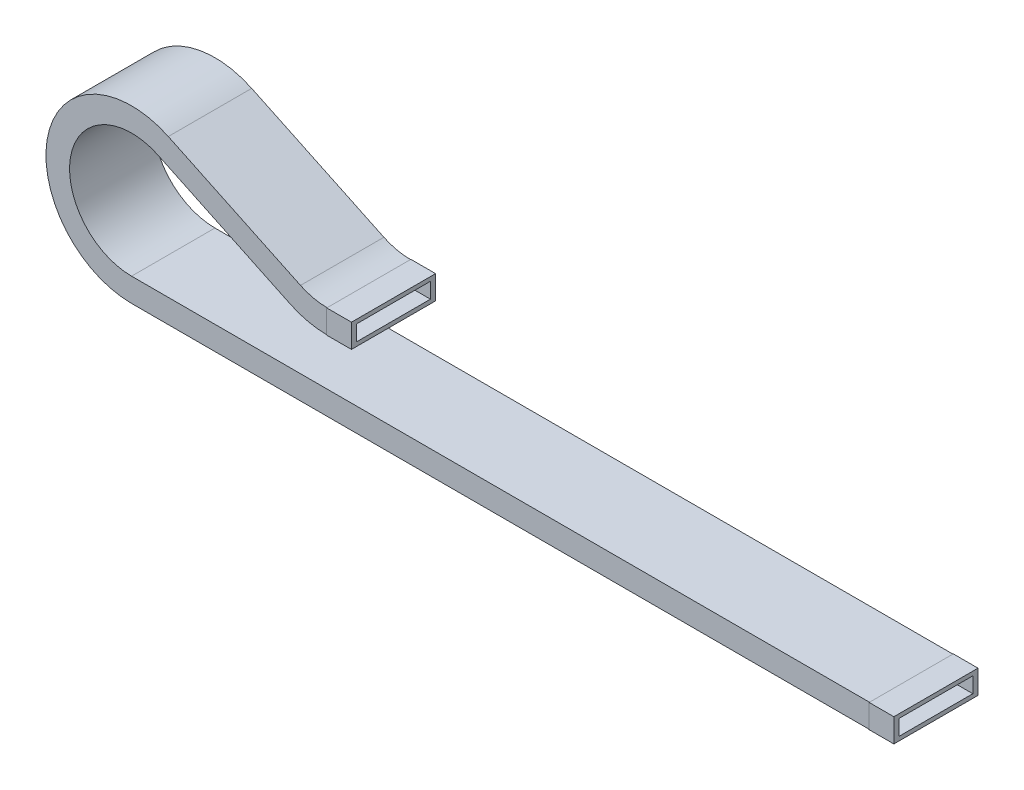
ISO-10303-21;
HEADER;
FILE_DESCRIPTION(('STEP AP214'),'2;1');
FILE_NAME('part.step','',(''),(''),'','','');
FILE_SCHEMA(('AUTOMOTIVE_DESIGN { 1 0 10303 214 1 1 1 1 }'));
ENDSEC;
DATA;
#1=APPLICATION_CONTEXT('core data for automotive mechanical design processes');
#2=APPLICATION_PROTOCOL_DEFINITION('international standard','automotive_design',2000,#1);
#3=PRODUCT_CONTEXT('',#1,'mechanical');
#4=PRODUCT('Part','Part','',(#3));
#5=PRODUCT_RELATED_PRODUCT_CATEGORY('part','',(#4));
#6=PRODUCT_DEFINITION_FORMATION('','',#4);
#7=PRODUCT_DEFINITION_CONTEXT('part definition',#1,'design');
#8=PRODUCT_DEFINITION('design','',#6,#7);
#9=PRODUCT_DEFINITION_SHAPE('','',#8);
#10=(LENGTH_UNIT() NAMED_UNIT(*) SI_UNIT(.MILLI.,.METRE.));
#11=(NAMED_UNIT(*) PLANE_ANGLE_UNIT() SI_UNIT($,.RADIAN.));
#12=(NAMED_UNIT(*) SI_UNIT($,.STERADIAN.) SOLID_ANGLE_UNIT());
#13=UNCERTAINTY_MEASURE_WITH_UNIT(LENGTH_MEASURE(1.E-05),#10,'distance_accuracy_value','');
#14=(GEOMETRIC_REPRESENTATION_CONTEXT(3) GLOBAL_UNCERTAINTY_ASSIGNED_CONTEXT((#13)) GLOBAL_UNIT_ASSIGNED_CONTEXT((#10,
#11,#12)) REPRESENTATION_CONTEXT('',''));
#15=CARTESIAN_POINT('',(0.,0.,0.));
#16=DIRECTION('',(0.,0.,1.));
#17=DIRECTION('',(1.,0.,0.));
#18=AXIS2_PLACEMENT_3D('',#15,#16,#17);
#19=CARTESIAN_POINT('',(-2067.,9.07607322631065E-12,113.));
#20=DIRECTION('',(0.,1.,0.));
#21=DIRECTION('',(0.,0.,1.));
#22=AXIS2_PLACEMENT_3D('',#19,#20,#21);
#23=PLANE('',#22);
#24=DIRECTION('',(0.,0.,1.));
#25=VECTOR('',#24,1.);
#26=CARTESIAN_POINT('',(-2067.,9.07607322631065E-12,113.));
#27=LINE('',#26,#25);
#28=CARTESIAN_POINT('',(-2067.,9.07607322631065E-12,-113.));
#29=VERTEX_POINT('',#28);
#30=CARTESIAN_POINT('',(-2067.,9.07607322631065E-12,113.));
#31=VERTEX_POINT('',#30);
#32=EDGE_CURVE('P0_E394',#29,#31,#27,.T.);
#33=ORIENTED_EDGE('',*,*,#32,.F.);
#34=DIRECTION('',(1.,0.,0.));
#35=VECTOR('',#34,1.);
#36=CARTESIAN_POINT('',(-2067.,9.07607322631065E-12,-113.));
#37=LINE('',#36,#35);
#38=CARTESIAN_POINT('',(-67.0000000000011,9.07607322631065E-12,-113.));
#39=VERTEX_POINT('',#38);
#40=EDGE_CURVE('P0_E24',#29,#39,#37,.T.);
#41=ORIENTED_EDGE('',*,*,#40,.T.);
#42=DIRECTION('',(0.,0.,1.));
#43=VECTOR('',#42,1.);
#44=CARTESIAN_POINT('',(-67.0000000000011,9.07607322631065E-12,113.));
#45=LINE('',#44,#43);
#46=CARTESIAN_POINT('',(-67.0000000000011,9.07607322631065E-12,113.));
#47=VERTEX_POINT('',#46);
#48=EDGE_CURVE('P0_E35',#39,#47,#45,.T.);
#49=ORIENTED_EDGE('',*,*,#48,.T.);
#50=DIRECTION('',(1.,0.,0.));
#51=VECTOR('',#50,1.);
#52=CARTESIAN_POINT('',(-2067.,9.07607322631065E-12,113.));
#53=LINE('',#52,#51);
#54=EDGE_CURVE('P0_E11',#31,#47,#53,.T.);
#55=ORIENTED_EDGE('',*,*,#54,.F.);
#56=EDGE_LOOP('',(#33,#41,#49,#55));
#57=FACE_BOUND('',#56,.T.);
#58=ADVANCED_FACE('P0_F16',(#57),#23,.F.);
#59=CARTESIAN_POINT('',(-2067.,64.0000000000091,113.));
#60=DIRECTION('',(0.,-1.,0.));
#61=DIRECTION('',(0.,0.,-1.));
#62=AXIS2_PLACEMENT_3D('',#59,#60,#61);
#63=PLANE('',#62);
#64=DIRECTION('',(0.,0.,-1.));
#65=VECTOR('',#64,1.);
#66=CARTESIAN_POINT('',(-2067.,64.0000000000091,113.));
#67=LINE('',#66,#65);
#68=CARTESIAN_POINT('',(-2067.,64.0000000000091,113.));
#69=VERTEX_POINT('',#68);
#70=CARTESIAN_POINT('',(-2067.,64.0000000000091,-113.));
#71=VERTEX_POINT('',#70);
#72=EDGE_CURVE('P0_E390',#69,#71,#67,.T.);
#73=ORIENTED_EDGE('',*,*,#72,.F.);
#74=DIRECTION('',(1.,0.,0.));
#75=VECTOR('',#74,1.);
#76=CARTESIAN_POINT('',(-2067.,64.0000000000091,113.));
#77=LINE('',#76,#75);
#78=CARTESIAN_POINT('',(-67.0000000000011,64.0000000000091,113.));
#79=VERTEX_POINT('',#78);
#80=EDGE_CURVE('P0_E426',#69,#79,#77,.T.);
#81=ORIENTED_EDGE('',*,*,#80,.T.);
#82=DIRECTION('',(0.,0.,-1.));
#83=VECTOR('',#82,1.);
#84=CARTESIAN_POINT('',(-67.0000000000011,64.0000000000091,113.));
#85=LINE('',#84,#83);
#86=CARTESIAN_POINT('',(-67.0000000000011,64.0000000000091,-113.));
#87=VERTEX_POINT('',#86);
#88=EDGE_CURVE('P0_E418',#79,#87,#85,.T.);
#89=ORIENTED_EDGE('',*,*,#88,.T.);
#90=DIRECTION('',(1.,0.,0.));
#91=VECTOR('',#90,1.);
#92=CARTESIAN_POINT('',(-2067.,64.0000000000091,-113.));
#93=LINE('',#92,#91);
#94=EDGE_CURVE('P0_E444',#71,#87,#93,.T.);
#95=ORIENTED_EDGE('',*,*,#94,.F.);
#96=EDGE_LOOP('',(#73,#81,#89,#95));
#97=FACE_BOUND('',#96,.T.);
#98=ADVANCED_FACE('P0_F565',(#97),#63,.F.);
#99=CARTESIAN_POINT('',(-2067.,53.0000000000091,100.));
#100=DIRECTION('',(0.,-1.,0.));
#101=DIRECTION('',(0.,0.,-1.));
#102=AXIS2_PLACEMENT_3D('',#99,#100,#101);
#103=PLANE('',#102);
#104=DIRECTION('',(0.,0.,-1.));
#105=VECTOR('',#104,1.);
#106=CARTESIAN_POINT('',(-2067.,53.0000000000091,100.));
#107=LINE('',#106,#105);
#108=CARTESIAN_POINT('',(-2067.,53.0000000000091,100.));
#109=VERTEX_POINT('',#108);
#110=CARTESIAN_POINT('',(-2067.,53.0000000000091,-99.9999999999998));
#111=VERTEX_POINT('',#110);
#112=EDGE_CURVE('P0_E386',#109,#111,#107,.T.);
#113=ORIENTED_EDGE('',*,*,#112,.T.);
#114=DIRECTION('',(1.,0.,0.));
#115=VECTOR('',#114,1.);
#116=CARTESIAN_POINT('',(-2067.,53.0000000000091,-99.9999999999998));
#117=LINE('',#116,#115);
#118=CARTESIAN_POINT('',(-67.0000000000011,53.0000000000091,-99.9999999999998));
#119=VERTEX_POINT('',#118);
#120=EDGE_CURVE('P0_E434',#111,#119,#117,.T.);
#121=ORIENTED_EDGE('',*,*,#120,.T.);
#122=DIRECTION('',(0.,0.,-1.));
#123=VECTOR('',#122,1.);
#124=CARTESIAN_POINT('',(-67.0000000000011,53.0000000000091,100.));
#125=LINE('',#124,#123);
#126=CARTESIAN_POINT('',(-67.0000000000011,53.0000000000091,100.));
#127=VERTEX_POINT('',#126);
#128=EDGE_CURVE('P0_E410',#127,#119,#125,.T.);
#129=ORIENTED_EDGE('',*,*,#128,.F.);
#130=DIRECTION('',(1.,0.,0.));
#131=VECTOR('',#130,1.);
#132=CARTESIAN_POINT('',(-2067.,53.0000000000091,100.));
#133=LINE('',#132,#131);
#134=EDGE_CURVE('P0_E419',#109,#127,#133,.T.);
#135=ORIENTED_EDGE('',*,*,#134,.F.);
#136=EDGE_LOOP('',(#113,#121,#129,#135));
#137=FACE_BOUND('',#136,.T.);
#138=ADVANCED_FACE('P0_F539',(#137),#103,.T.);
#139=CARTESIAN_POINT('',(-2067.,11.0000000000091,100.));
#140=DIRECTION('',(0.,1.,0.));
#141=DIRECTION('',(0.,0.,1.));
#142=AXIS2_PLACEMENT_3D('',#139,#140,#141);
#143=PLANE('',#142);
#144=DIRECTION('',(0.,0.,1.));
#145=VECTOR('',#144,1.);
#146=CARTESIAN_POINT('',(-2067.,11.0000000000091,100.));
#147=LINE('',#146,#145);
#148=CARTESIAN_POINT('',(-2067.,11.0000000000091,-99.9999999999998));
#149=VERTEX_POINT('',#148);
#150=CARTESIAN_POINT('',(-2067.,11.0000000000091,100.));
#151=VERTEX_POINT('',#150);
#152=EDGE_CURVE('P0_E382',#149,#151,#147,.T.);
#153=ORIENTED_EDGE('',*,*,#152,.T.);
#154=DIRECTION('',(1.,0.,0.));
#155=VECTOR('',#154,1.);
#156=CARTESIAN_POINT('',(-2067.,11.0000000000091,100.));
#157=LINE('',#156,#155);
#158=CARTESIAN_POINT('',(-67.0000000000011,11.0000000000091,100.));
#159=VERTEX_POINT('',#158);
#160=EDGE_CURVE('P0_E414',#151,#159,#157,.T.);
#161=ORIENTED_EDGE('',*,*,#160,.T.);
#162=DIRECTION('',(0.,0.,1.));
#163=VECTOR('',#162,1.);
#164=CARTESIAN_POINT('',(-67.0000000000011,11.0000000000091,100.));
#165=LINE('',#164,#163);
#166=CARTESIAN_POINT('',(-67.0000000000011,11.0000000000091,-99.9999999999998));
#167=VERTEX_POINT('',#166);
#168=EDGE_CURVE('P0_E402',#167,#159,#165,.T.);
#169=ORIENTED_EDGE('',*,*,#168,.F.);
#170=DIRECTION('',(1.,0.,0.));
#171=VECTOR('',#170,1.);
#172=CARTESIAN_POINT('',(-2067.,11.0000000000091,-99.9999999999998));
#173=LINE('',#172,#171);
#174=EDGE_CURVE('P0_E430',#149,#167,#173,.T.);
#175=ORIENTED_EDGE('',*,*,#174,.F.);
#176=EDGE_LOOP('',(#153,#161,#169,#175));
#177=FACE_BOUND('',#176,.T.);
#178=ADVANCED_FACE('P0_F546',(#177),#143,.T.);
#179=CARTESIAN_POINT('',(-2067.,232.010000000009,1.89806750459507E-13));
#180=DIRECTION('',(0.,0.,1.));
#181=DIRECTION('',(1.,0.,0.));
#182=AXIS2_PLACEMENT_3D('',#179,#180,#181);
#183=CYLINDRICAL_SURFACE('',#182,232.01);
#184=DIRECTION('',(0.,0.,1.));
#185=VECTOR('',#184,1.);
#186=CARTESIAN_POINT('',(-1967.40267090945,441.554773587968,113.));
#187=LINE('',#186,#185);
#188=CARTESIAN_POINT('',(-1967.40267090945,441.554773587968,-113.));
#189=VERTEX_POINT('',#188);
#190=CARTESIAN_POINT('',(-1967.40267090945,441.554773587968,113.));
#191=VERTEX_POINT('',#190);
#192=EDGE_CURVE('P0_E324',#189,#191,#187,.T.);
#193=ORIENTED_EDGE('',*,*,#192,.F.);
#194=CARTESIAN_POINT('',(-2067.,232.010000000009,-113.));
#195=DIRECTION('',(0.,0.,1.));
#196=DIRECTION('',(1.,0.,0.));
#197=AXIS2_PLACEMENT_3D('',#194,#195,#196);
#198=CIRCLE('',#197,232.01);
#199=EDGE_CURVE('P0_E376',#189,#29,#198,.T.);
#200=ORIENTED_EDGE('',*,*,#199,.T.);
#201=ORIENTED_EDGE('',*,*,#32,.T.);
#202=CARTESIAN_POINT('',(-2067.,232.010000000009,113.));
#203=DIRECTION('',(0.,0.,1.));
#204=DIRECTION('',(1.,0.,0.));
#205=AXIS2_PLACEMENT_3D('',#202,#203,#204);
#206=CIRCLE('',#205,232.01);
#207=EDGE_CURVE('P0_E379',#191,#31,#206,.T.);
#208=ORIENTED_EDGE('',*,*,#207,.F.);
#209=EDGE_LOOP('',(#193,#200,#201,#208));
#210=FACE_BOUND('',#209,.T.);
#211=ADVANCED_FACE('P0_F453',(#210),#183,.T.);
#212=CARTESIAN_POINT('',(-2067.,232.010000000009,1.89806750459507E-13));
#213=DIRECTION('',(0.,0.,1.));
#214=DIRECTION('',(1.,0.,0.));
#215=AXIS2_PLACEMENT_3D('',#212,#213,#214);
#216=CYLINDRICAL_SURFACE('',#215,168.01);
#217=DIRECTION('',(0.,0.,-1.));
#218=VECTOR('',#217,1.);
#219=CARTESIAN_POINT('',(-1994.87661195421,383.75181031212,113.));
#220=LINE('',#219,#218);
#221=CARTESIAN_POINT('',(-1994.87661195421,383.75181031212,113.));
#222=VERTEX_POINT('',#221);
#223=CARTESIAN_POINT('',(-1994.87661195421,383.75181031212,-113.));
#224=VERTEX_POINT('',#223);
#225=EDGE_CURVE('P0_E320',#222,#224,#220,.T.);
#226=ORIENTED_EDGE('',*,*,#225,.F.);
#227=CARTESIAN_POINT('',(-2067.,232.010000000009,113.));
#228=DIRECTION('',(0.,0.,1.));
#229=DIRECTION('',(1.,0.,0.));
#230=AXIS2_PLACEMENT_3D('',#227,#228,#229);
#231=CIRCLE('',#230,168.01);
#232=EDGE_CURVE('P0_E370',#222,#69,#231,.T.);
#233=ORIENTED_EDGE('',*,*,#232,.T.);
#234=ORIENTED_EDGE('',*,*,#72,.T.);
#235=CARTESIAN_POINT('',(-2067.,232.010000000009,-113.));
#236=DIRECTION('',(0.,0.,1.));
#237=DIRECTION('',(1.,0.,0.));
#238=AXIS2_PLACEMENT_3D('',#235,#236,#237);
#239=CIRCLE('',#238,168.01);
#240=EDGE_CURVE('P0_E373',#224,#71,#239,.T.);
#241=ORIENTED_EDGE('',*,*,#240,.F.);
#242=EDGE_LOOP('',(#226,#233,#234,#241));
#243=FACE_BOUND('',#242,.T.);
#244=ADVANCED_FACE('P0_F580',(#243),#216,.F.);
#245=CARTESIAN_POINT('',(-2067.,232.010000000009,1.89806750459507E-13));
#246=DIRECTION('',(0.,0.,1.));
#247=DIRECTION('',(1.,0.,0.));
#248=AXIS2_PLACEMENT_3D('',#245,#246,#247);
#249=CYLINDRICAL_SURFACE('',#248,179.01);
#250=DIRECTION('',(0.,0.,-1.));
#251=VECTOR('',#250,1.);
#252=CARTESIAN_POINT('',(-1990.15452833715,393.686694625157,100.));
#253=LINE('',#252,#251);
#254=CARTESIAN_POINT('',(-1990.15452833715,393.686694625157,100.));
#255=VERTEX_POINT('',#254);
#256=CARTESIAN_POINT('',(-1990.15452833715,393.686694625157,-99.9999999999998));
#257=VERTEX_POINT('',#256);
#258=EDGE_CURVE('P0_E316',#255,#257,#253,.T.);
#259=ORIENTED_EDGE('',*,*,#258,.T.);
#260=CARTESIAN_POINT('',(-2067.,232.010000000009,-99.9999999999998));
#261=DIRECTION('',(0.,0.,1.));
#262=DIRECTION('',(1.,0.,0.));
#263=AXIS2_PLACEMENT_3D('',#260,#261,#262);
#264=CIRCLE('',#263,179.01);
#265=EDGE_CURVE('P0_E364',#257,#111,#264,.T.);
#266=ORIENTED_EDGE('',*,*,#265,.T.);
#267=ORIENTED_EDGE('',*,*,#112,.F.);
#268=CARTESIAN_POINT('',(-2067.,232.010000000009,100.));
#269=DIRECTION('',(0.,0.,1.));
#270=DIRECTION('',(1.,0.,0.));
#271=AXIS2_PLACEMENT_3D('',#268,#269,#270);
#272=CIRCLE('',#271,179.01);
#273=EDGE_CURVE('P0_E367',#255,#109,#272,.T.);
#274=ORIENTED_EDGE('',*,*,#273,.F.);
#275=EDGE_LOOP('',(#259,#266,#267,#274));
#276=FACE_BOUND('',#275,.T.);
#277=ADVANCED_FACE('P0_F535',(#276),#249,.T.);
#278=CARTESIAN_POINT('',(-2067.,232.010000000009,1.89806750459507E-13));
#279=DIRECTION('',(0.,0.,1.));
#280=DIRECTION('',(1.,0.,0.));
#281=AXIS2_PLACEMENT_3D('',#278,#279,#280);
#282=CYLINDRICAL_SURFACE('',#281,221.01);
#283=DIRECTION('',(0.,0.,1.));
#284=VECTOR('',#283,1.);
#285=CARTESIAN_POINT('',(-1972.12475452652,431.619889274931,100.));
#286=LINE('',#285,#284);
#287=CARTESIAN_POINT('',(-1972.12475452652,431.619889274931,-99.9999999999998));
#288=VERTEX_POINT('',#287);
#289=CARTESIAN_POINT('',(-1972.12475452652,431.619889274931,100.));
#290=VERTEX_POINT('',#289);
#291=EDGE_CURVE('P0_E312',#288,#290,#286,.T.);
#292=ORIENTED_EDGE('',*,*,#291,.T.);
#293=CARTESIAN_POINT('',(-2067.,232.010000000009,100.));
#294=DIRECTION('',(0.,0.,1.));
#295=DIRECTION('',(1.,0.,0.));
#296=AXIS2_PLACEMENT_3D('',#293,#294,#295);
#297=CIRCLE('',#296,221.01);
#298=EDGE_CURVE('P0_E358',#290,#151,#297,.T.);
#299=ORIENTED_EDGE('',*,*,#298,.T.);
#300=ORIENTED_EDGE('',*,*,#152,.F.);
#301=CARTESIAN_POINT('',(-2067.,232.010000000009,-99.9999999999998));
#302=DIRECTION('',(0.,0.,1.));
#303=DIRECTION('',(1.,0.,0.));
#304=AXIS2_PLACEMENT_3D('',#301,#302,#303);
#305=CIRCLE('',#304,221.01);
#306=EDGE_CURVE('P0_E361',#288,#149,#305,.T.);
#307=ORIENTED_EDGE('',*,*,#306,.F.);
#308=EDGE_LOOP('',(#292,#299,#300,#307));
#309=FACE_BOUND('',#308,.T.);
#310=ADVANCED_FACE('P0_F549',(#309),#282,.F.);
#311=CARTESIAN_POINT('',(-1609.13338804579,271.268189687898,113.));
#312=DIRECTION('',(-0.429280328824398,-0.903171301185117,0.));
#313=DIRECTION('',(0.903171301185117,-0.429280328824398,0.));
#314=AXIS2_PLACEMENT_3D('',#311,#312,#313);
#315=PLANE('',#314);
#316=DIRECTION('',(0.,0.,1.));
#317=VECTOR('',#316,1.);
#318=CARTESIAN_POINT('',(-1609.13338804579,271.268189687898,113.));
#319=LINE('',#318,#317);
#320=CARTESIAN_POINT('',(-1609.13338804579,271.268189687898,-113.));
#321=VERTEX_POINT('',#320);
#322=CARTESIAN_POINT('',(-1609.13338804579,271.268189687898,113.));
#323=VERTEX_POINT('',#322);
#324=EDGE_CURVE('P0_E282',#321,#323,#319,.T.);
#325=ORIENTED_EDGE('',*,*,#324,.F.);
#326=DIRECTION('',(-0.903171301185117,0.429280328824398,0.));
#327=VECTOR('',#326,1.);
#328=CARTESIAN_POINT('',(-1609.13338804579,271.268189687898,-113.));
#329=LINE('',#328,#327);
#330=EDGE_CURVE('P0_E350',#321,#189,#329,.T.);
#331=ORIENTED_EDGE('',*,*,#330,.T.);
#332=ORIENTED_EDGE('',*,*,#192,.T.);
#333=DIRECTION('',(-0.903171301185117,0.429280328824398,0.));
#334=VECTOR('',#333,1.);
#335=CARTESIAN_POINT('',(-1609.13338804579,271.268189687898,113.));
#336=LINE('',#335,#334);
#337=EDGE_CURVE('P0_E354',#323,#191,#336,.T.);
#338=ORIENTED_EDGE('',*,*,#337,.F.);
#339=EDGE_LOOP('',(#325,#331,#332,#338));
#340=FACE_BOUND('',#339,.T.);
#341=ADVANCED_FACE('P0_F455',(#340),#315,.F.);
#342=CARTESIAN_POINT('',(-1636.60732909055,213.46522641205,113.));
#343=DIRECTION('',(0.429280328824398,0.903171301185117,0.));
#344=DIRECTION('',(-0.903171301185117,0.429280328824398,0.));
#345=AXIS2_PLACEMENT_3D('',#342,#343,#344);
#346=PLANE('',#345);
#347=DIRECTION('',(0.,0.,-1.));
#348=VECTOR('',#347,1.);
#349=CARTESIAN_POINT('',(-1636.60732909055,213.46522641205,113.));
#350=LINE('',#349,#348);
#351=CARTESIAN_POINT('',(-1636.60732909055,213.46522641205,113.));
#352=VERTEX_POINT('',#351);
#353=CARTESIAN_POINT('',(-1636.60732909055,213.46522641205,-113.));
#354=VERTEX_POINT('',#353);
#355=EDGE_CURVE('P0_E278',#352,#354,#350,.T.);
#356=ORIENTED_EDGE('',*,*,#355,.F.);
#357=DIRECTION('',(-0.903171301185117,0.429280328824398,0.));
#358=VECTOR('',#357,1.);
#359=CARTESIAN_POINT('',(-1636.60732909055,213.46522641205,113.));
#360=LINE('',#359,#358);
#361=EDGE_CURVE('P0_E329',#352,#222,#360,.T.);
#362=ORIENTED_EDGE('',*,*,#361,.T.);
#363=ORIENTED_EDGE('',*,*,#225,.T.);
#364=DIRECTION('',(-0.903171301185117,0.429280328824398,0.));
#365=VECTOR('',#364,1.);
#366=CARTESIAN_POINT('',(-1636.60732909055,213.46522641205,-113.));
#367=LINE('',#366,#365);
#368=EDGE_CURVE('P0_E346',#354,#224,#367,.T.);
#369=ORIENTED_EDGE('',*,*,#368,.F.);
#370=EDGE_LOOP('',(#356,#362,#363,#369));
#371=FACE_BOUND('',#370,.T.);
#372=ADVANCED_FACE('P0_F562',(#371),#346,.F.);
#373=CARTESIAN_POINT('',(-1631.88524547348,223.400110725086,100.));
#374=DIRECTION('',(0.429280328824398,0.903171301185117,0.));
#375=DIRECTION('',(-0.903171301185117,0.429280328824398,0.));
#376=AXIS2_PLACEMENT_3D('',#373,#374,#375);
#377=PLANE('',#376);
#378=DIRECTION('',(0.,0.,-1.));
#379=VECTOR('',#378,1.);
#380=CARTESIAN_POINT('',(-1631.88524547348,223.400110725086,100.));
#381=LINE('',#380,#379);
#382=CARTESIAN_POINT('',(-1631.88524547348,223.400110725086,100.));
#383=VERTEX_POINT('',#382);
#384=CARTESIAN_POINT('',(-1631.88524547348,223.400110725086,-99.9999999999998));
#385=VERTEX_POINT('',#384);
#386=EDGE_CURVE('P0_E239',#383,#385,#381,.T.);
#387=ORIENTED_EDGE('',*,*,#386,.T.);
#388=DIRECTION('',(-0.903171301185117,0.429280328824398,0.));
#389=VECTOR('',#388,1.);
#390=CARTESIAN_POINT('',(-1631.88524547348,223.400110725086,-99.9999999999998));
#391=LINE('',#390,#389);
#392=EDGE_CURVE('P0_E336',#385,#257,#391,.T.);
#393=ORIENTED_EDGE('',*,*,#392,.T.);
#394=ORIENTED_EDGE('',*,*,#258,.F.);
#395=DIRECTION('',(-0.903171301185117,0.429280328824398,0.));
#396=VECTOR('',#395,1.);
#397=CARTESIAN_POINT('',(-1631.88524547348,223.400110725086,100.));
#398=LINE('',#397,#396);
#399=EDGE_CURVE('P0_E325',#383,#255,#398,.T.);
#400=ORIENTED_EDGE('',*,*,#399,.F.);
#401=EDGE_LOOP('',(#387,#393,#394,#400));
#402=FACE_BOUND('',#401,.T.);
#403=ADVANCED_FACE('P0_F533',(#402),#377,.T.);
#404=CARTESIAN_POINT('',(-1613.85547166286,261.333305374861,100.));
#405=DIRECTION('',(-0.429280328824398,-0.903171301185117,0.));
#406=DIRECTION('',(0.903171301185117,-0.429280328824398,0.));
#407=AXIS2_PLACEMENT_3D('',#404,#405,#406);
#408=PLANE('',#407);
#409=DIRECTION('',(0.,0.,1.));
#410=VECTOR('',#409,1.);
#411=CARTESIAN_POINT('',(-1613.85547166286,261.333305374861,100.));
#412=LINE('',#411,#410);
#413=CARTESIAN_POINT('',(-1613.85547166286,261.333305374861,-99.9999999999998));
#414=VERTEX_POINT('',#413);
#415=CARTESIAN_POINT('',(-1613.85547166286,261.333305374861,100.));
#416=VERTEX_POINT('',#415);
#417=EDGE_CURVE('P0_E271',#414,#416,#412,.T.);
#418=ORIENTED_EDGE('',*,*,#417,.T.);
#419=DIRECTION('',(-0.903171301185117,0.429280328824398,0.));
#420=VECTOR('',#419,1.);
#421=CARTESIAN_POINT('',(-1613.85547166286,261.333305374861,100.));
#422=LINE('',#421,#420);
#423=EDGE_CURVE('P0_E233',#416,#290,#422,.T.);
#424=ORIENTED_EDGE('',*,*,#423,.T.);
#425=ORIENTED_EDGE('',*,*,#291,.F.);
#426=DIRECTION('',(-0.903171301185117,0.429280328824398,0.));
#427=VECTOR('',#426,1.);
#428=CARTESIAN_POINT('',(-1613.85547166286,261.333305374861,-99.9999999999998));
#429=LINE('',#428,#427);
#430=EDGE_CURVE('P0_E332',#414,#288,#429,.T.);
#431=ORIENTED_EDGE('',*,*,#430,.F.);
#432=EDGE_LOOP('',(#418,#424,#425,#431));
#433=FACE_BOUND('',#432,.T.);
#434=ADVANCED_FACE('P0_F552',(#433),#408,.T.);
#435=CARTESIAN_POINT('',(-1537.01,423.010000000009,1.89806750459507E-13));
#436=DIRECTION('',(0.,0.,-1.));
#437=DIRECTION('',(-1.,0.,0.));
#438=AXIS2_PLACEMENT_3D('',#435,#436,#437);
#439=CYLINDRICAL_SURFACE('',#438,168.01);
#440=DIRECTION('',(0.,0.,1.));
#441=VECTOR('',#440,1.);
#442=CARTESIAN_POINT('',(-1537.01,255.000000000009,113.));
#443=LINE('',#442,#441);
#444=CARTESIAN_POINT('',(-1537.01,255.000000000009,-113.));
#445=VERTEX_POINT('',#444);
#446=CARTESIAN_POINT('',(-1537.01,255.000000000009,113.));
#447=VERTEX_POINT('',#446);
#448=EDGE_CURVE('P0_E257',#445,#447,#443,.T.);
#449=ORIENTED_EDGE('',*,*,#448,.F.);
#450=CARTESIAN_POINT('',(-1537.01,423.010000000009,-113.));
#451=DIRECTION('',(0.,0.,-1.));
#452=DIRECTION('',(-1.,0.,0.));
#453=AXIS2_PLACEMENT_3D('',#450,#451,#452);
#454=CIRCLE('',#453,168.01);
#455=EDGE_CURVE('P0_E304',#445,#321,#454,.T.);
#456=ORIENTED_EDGE('',*,*,#455,.T.);
#457=ORIENTED_EDGE('',*,*,#324,.T.);
#458=CARTESIAN_POINT('',(-1537.01,423.010000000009,113.));
#459=DIRECTION('',(0.,0.,-1.));
#460=DIRECTION('',(-1.,0.,0.));
#461=AXIS2_PLACEMENT_3D('',#458,#459,#460);
#462=CIRCLE('',#461,168.01);
#463=EDGE_CURVE('P0_E308',#447,#323,#462,.T.);
#464=ORIENTED_EDGE('',*,*,#463,.F.);
#465=EDGE_LOOP('',(#449,#456,#457,#464));
#466=FACE_BOUND('',#465,.T.);
#467=ADVANCED_FACE('P0_F458',(#466),#439,.F.);
#468=CARTESIAN_POINT('',(-1537.01,423.010000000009,1.89806750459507E-13));
#469=DIRECTION('',(0.,0.,-1.));
#470=DIRECTION('',(-1.,0.,0.));
#471=AXIS2_PLACEMENT_3D('',#468,#469,#470);
#472=CYLINDRICAL_SURFACE('',#471,232.01);
#473=DIRECTION('',(0.,0.,-1.));
#474=VECTOR('',#473,1.);
#475=CARTESIAN_POINT('',(-1537.01,191.000000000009,113.));
#476=LINE('',#475,#474);
#477=CARTESIAN_POINT('',(-1537.01,191.000000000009,113.));
#478=VERTEX_POINT('',#477);
#479=CARTESIAN_POINT('',(-1537.01,191.000000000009,-113.));
#480=VERTEX_POINT('',#479);
#481=EDGE_CURVE('P0_E267',#478,#480,#476,.T.);
#482=ORIENTED_EDGE('',*,*,#481,.F.);
#483=CARTESIAN_POINT('',(-1537.01,423.010000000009,113.));
#484=DIRECTION('',(0.,0.,-1.));
#485=DIRECTION('',(-1.,0.,0.));
#486=AXIS2_PLACEMENT_3D('',#483,#484,#485);
#487=CIRCLE('',#486,232.01);
#488=EDGE_CURVE('P0_E286',#478,#352,#487,.T.);
#489=ORIENTED_EDGE('',*,*,#488,.T.);
#490=ORIENTED_EDGE('',*,*,#355,.T.);
#491=CARTESIAN_POINT('',(-1537.01,423.010000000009,-113.));
#492=DIRECTION('',(0.,0.,-1.));
#493=DIRECTION('',(-1.,0.,0.));
#494=AXIS2_PLACEMENT_3D('',#491,#492,#493);
#495=CIRCLE('',#494,232.01);
#496=EDGE_CURVE('P0_E300',#480,#354,#495,.T.);
#497=ORIENTED_EDGE('',*,*,#496,.F.);
#498=EDGE_LOOP('',(#482,#489,#490,#497));
#499=FACE_BOUND('',#498,.T.);
#500=ADVANCED_FACE('P0_F560',(#499),#472,.T.);
#501=CARTESIAN_POINT('',(-1537.01,423.010000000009,1.89806750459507E-13));
#502=DIRECTION('',(0.,0.,-1.));
#503=DIRECTION('',(-1.,0.,0.));
#504=AXIS2_PLACEMENT_3D('',#501,#502,#503);
#505=CYLINDRICAL_SURFACE('',#504,221.01);
#506=DIRECTION('',(0.,0.,-1.));
#507=VECTOR('',#506,1.);
#508=CARTESIAN_POINT('',(-1537.01,202.000000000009,100.));
#509=LINE('',#508,#507);
#510=CARTESIAN_POINT('',(-1537.01,202.000000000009,100.));
#511=VERTEX_POINT('',#510);
#512=CARTESIAN_POINT('',(-1537.01,202.000000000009,-99.9999999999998));
#513=VERTEX_POINT('',#512);
#514=EDGE_CURVE('P0_E249',#511,#513,#509,.T.);
#515=ORIENTED_EDGE('',*,*,#514,.T.);
#516=CARTESIAN_POINT('',(-1537.01,423.010000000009,-99.9999999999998));
#517=DIRECTION('',(0.,0.,-1.));
#518=DIRECTION('',(-1.,0.,0.));
#519=AXIS2_PLACEMENT_3D('',#516,#517,#518);
#520=CIRCLE('',#519,221.01);
#521=EDGE_CURVE('P0_E290',#513,#385,#520,.T.);
#522=ORIENTED_EDGE('',*,*,#521,.T.);
#523=ORIENTED_EDGE('',*,*,#386,.F.);
#524=CARTESIAN_POINT('',(-1537.01,423.010000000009,100.));
#525=DIRECTION('',(0.,0.,-1.));
#526=DIRECTION('',(-1.,0.,0.));
#527=AXIS2_PLACEMENT_3D('',#524,#525,#526);
#528=CIRCLE('',#527,221.01);
#529=EDGE_CURVE('P0_E283',#511,#383,#528,.T.);
#530=ORIENTED_EDGE('',*,*,#529,.F.);
#531=EDGE_LOOP('',(#515,#522,#523,#530));
#532=FACE_BOUND('',#531,.T.);
#533=ADVANCED_FACE('P0_F527',(#532),#505,.F.);
#534=CARTESIAN_POINT('',(-1537.01,423.010000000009,1.89806750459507E-13));
#535=DIRECTION('',(0.,0.,-1.));
#536=DIRECTION('',(-1.,0.,0.));
#537=AXIS2_PLACEMENT_3D('',#534,#535,#536);
#538=CYLINDRICAL_SURFACE('',#537,179.01);
#539=DIRECTION('',(0.,0.,1.));
#540=VECTOR('',#539,1.);
#541=CARTESIAN_POINT('',(-1537.01,244.000000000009,100.));
#542=LINE('',#541,#540);
#543=CARTESIAN_POINT('',(-1537.01,244.000000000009,-99.9999999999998));
#544=VERTEX_POINT('',#543);
#545=CARTESIAN_POINT('',(-1537.01,244.000000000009,100.));
#546=VERTEX_POINT('',#545);
#547=EDGE_CURVE('P0_E242',#544,#546,#542,.T.);
#548=ORIENTED_EDGE('',*,*,#547,.T.);
#549=CARTESIAN_POINT('',(-1537.01,423.010000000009,100.));
#550=DIRECTION('',(0.,0.,-1.));
#551=DIRECTION('',(-1.,0.,0.));
#552=AXIS2_PLACEMENT_3D('',#549,#550,#551);
#553=CIRCLE('',#552,179.01);
#554=EDGE_CURVE('P0_E225',#546,#416,#553,.T.);
#555=ORIENTED_EDGE('',*,*,#554,.T.);
#556=ORIENTED_EDGE('',*,*,#417,.F.);
#557=CARTESIAN_POINT('',(-1537.01,423.010000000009,-99.9999999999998));
#558=DIRECTION('',(0.,0.,-1.));
#559=DIRECTION('',(-1.,0.,0.));
#560=AXIS2_PLACEMENT_3D('',#557,#558,#559);
#561=CIRCLE('',#560,179.01);
#562=EDGE_CURVE('P0_E238',#544,#414,#561,.T.);
#563=ORIENTED_EDGE('',*,*,#562,.F.);
#564=EDGE_LOOP('',(#548,#555,#556,#563));
#565=FACE_BOUND('',#564,.T.);
#566=ADVANCED_FACE('P0_F243',(#565),#538,.T.);
#567=CARTESIAN_POINT('',(-1537.01,255.000000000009,113.));
#568=DIRECTION('',(0.,0.,1.));
#569=DIRECTION('',(1.,0.,0.));
#570=AXIS2_PLACEMENT_3D('',#567,#568,#569);
#571=PLANE('',#570);
#572=DIRECTION('',(0.,-1.,0.));
#573=VECTOR('',#572,1.);
#574=CARTESIAN_POINT('',(-1537.,255.000000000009,113.));
#575=LINE('',#574,#573);
#576=CARTESIAN_POINT('',(-1537.,255.000000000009,113.));
#577=VERTEX_POINT('',#576);
#578=CARTESIAN_POINT('',(-1537.,191.000000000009,113.));
#579=VERTEX_POINT('',#578);
#580=EDGE_CURVE('P0_E509',#577,#579,#575,.T.);
#581=ORIENTED_EDGE('',*,*,#580,.F.);
#582=DIRECTION('',(1.,-8.32667268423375E-12,0.));
#583=VECTOR('',#582,1.);
#584=CARTESIAN_POINT('',(-1537.01,255.000000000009,113.));
#585=LINE('',#584,#583);
#586=EDGE_CURVE('P0_E274',#447,#577,#585,.T.);
#587=ORIENTED_EDGE('',*,*,#586,.F.);
#588=ORIENTED_EDGE('',*,*,#463,.T.);
#589=ORIENTED_EDGE('',*,*,#337,.T.);
#590=ORIENTED_EDGE('',*,*,#207,.T.);
#591=ORIENTED_EDGE('',*,*,#54,.T.);
#592=DIRECTION('',(0.,1.,0.));
#593=VECTOR('',#592,1.);
#594=CARTESIAN_POINT('',(-67.0000000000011,9.07607322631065E-12,113.));
#595=LINE('',#594,#593);
#596=EDGE_CURVE('P0_E415',#47,#79,#595,.T.);
#597=ORIENTED_EDGE('',*,*,#596,.T.);
#598=ORIENTED_EDGE('',*,*,#80,.F.);
#599=ORIENTED_EDGE('',*,*,#232,.F.);
#600=ORIENTED_EDGE('',*,*,#361,.F.);
#601=ORIENTED_EDGE('',*,*,#488,.F.);
#602=DIRECTION('',(1.,-8.32667268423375E-12,0.));
#603=VECTOR('',#602,1.);
#604=CARTESIAN_POINT('',(-1537.01,191.000000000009,113.));
#605=LINE('',#604,#603);
#606=EDGE_CURVE('P0_E488',#478,#579,#605,.T.);
#607=ORIENTED_EDGE('',*,*,#606,.T.);
#608=EDGE_LOOP('',(#581,#587,#588,#589,#590,#591,#597,#598,#599,#600,#601,#607));
#609=FACE_BOUND('',#608,.T.);
#610=ADVANCED_FACE('P0_F599',(#609),#571,.T.);
#611=CARTESIAN_POINT('',(-1537.01,255.000000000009,113.));
#612=DIRECTION('',(8.32667268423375E-12,1.,0.));
#613=DIRECTION('',(-1.,8.32667268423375E-12,0.));
#614=AXIS2_PLACEMENT_3D('',#611,#612,#613);
#615=PLANE('',#614);
#616=DIRECTION('',(0.,0.,1.));
#617=VECTOR('',#616,1.);
#618=CARTESIAN_POINT('',(-1537.,255.000000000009,113.));
#619=LINE('',#618,#617);
#620=CARTESIAN_POINT('',(-1537.,255.000000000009,-113.));
#621=VERTEX_POINT('',#620);
#622=EDGE_CURVE('P0_E250',#621,#577,#619,.T.);
#623=ORIENTED_EDGE('',*,*,#622,.F.);
#624=DIRECTION('',(1.,-8.32667268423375E-12,0.));
#625=VECTOR('',#624,1.);
#626=CARTESIAN_POINT('',(-1537.01,255.000000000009,-113.));
#627=LINE('',#626,#625);
#628=EDGE_CURVE('P0_E460',#445,#621,#627,.T.);
#629=ORIENTED_EDGE('',*,*,#628,.F.);
#630=ORIENTED_EDGE('',*,*,#448,.T.);
#631=ORIENTED_EDGE('',*,*,#586,.T.);
#632=EDGE_LOOP('',(#623,#629,#630,#631));
#633=FACE_BOUND('',#632,.T.);
#634=ADVANCED_FACE('P0_F478',(#633),#615,.T.);
#635=CARTESIAN_POINT('',(-1537.01,255.000000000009,-113.));
#636=DIRECTION('',(0.,0.,-1.));
#637=DIRECTION('',(-1.,0.,0.));
#638=AXIS2_PLACEMENT_3D('',#635,#636,#637);
#639=PLANE('',#638);
#640=DIRECTION('',(0.,1.,0.));
#641=VECTOR('',#640,1.);
#642=CARTESIAN_POINT('',(-1537.,255.000000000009,-113.));
#643=LINE('',#642,#641);
#644=CARTESIAN_POINT('',(-1537.,191.000000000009,-113.));
#645=VERTEX_POINT('',#644);
#646=EDGE_CURVE('P0_E463',#645,#621,#643,.T.);
#647=ORIENTED_EDGE('',*,*,#646,.F.);
#648=DIRECTION('',(1.,-8.32667268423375E-12,0.));
#649=VECTOR('',#648,1.);
#650=CARTESIAN_POINT('',(-1537.01,191.000000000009,-113.));
#651=LINE('',#650,#649);
#652=EDGE_CURVE('P0_E468',#480,#645,#651,.T.);
#653=ORIENTED_EDGE('',*,*,#652,.F.);
#654=ORIENTED_EDGE('',*,*,#496,.T.);
#655=ORIENTED_EDGE('',*,*,#368,.T.);
#656=ORIENTED_EDGE('',*,*,#240,.T.);
#657=ORIENTED_EDGE('',*,*,#94,.T.);
#658=DIRECTION('',(0.,-1.,0.));
#659=VECTOR('',#658,1.);
#660=CARTESIAN_POINT('',(-67.0000000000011,9.07607322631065E-12,-113.));
#661=LINE('',#660,#659);
#662=EDGE_CURVE('P0_E46',#87,#39,#661,.T.);
#663=ORIENTED_EDGE('',*,*,#662,.T.);
#664=ORIENTED_EDGE('',*,*,#40,.F.);
#665=ORIENTED_EDGE('',*,*,#199,.F.);
#666=ORIENTED_EDGE('',*,*,#330,.F.);
#667=ORIENTED_EDGE('',*,*,#455,.F.);
#668=ORIENTED_EDGE('',*,*,#628,.T.);
#669=EDGE_LOOP('',(#647,#653,#654,#655,#656,#657,#663,#664,#665,#666,#667,#668));
#670=FACE_BOUND('',#669,.T.);
#671=ADVANCED_FACE('P0_F449',(#670),#639,.T.);
#672=CARTESIAN_POINT('',(-1537.01,244.000000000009,100.));
#673=DIRECTION('',(0.,0.,1.));
#674=DIRECTION('',(1.,0.,0.));
#675=AXIS2_PLACEMENT_3D('',#672,#673,#674);
#676=PLANE('',#675);
#677=DIRECTION('',(0.,-1.,0.));
#678=VECTOR('',#677,1.);
#679=CARTESIAN_POINT('',(-1537.,244.000000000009,100.));
#680=LINE('',#679,#678);
#681=CARTESIAN_POINT('',(-1537.,244.000000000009,100.));
#682=VERTEX_POINT('',#681);
#683=CARTESIAN_POINT('',(-1537.,202.000000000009,100.));
#684=VERTEX_POINT('',#683);
#685=EDGE_CURVE('P0_E512',#682,#684,#680,.T.);
#686=ORIENTED_EDGE('',*,*,#685,.T.);
#687=DIRECTION('',(1.,-8.32667268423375E-12,0.));
#688=VECTOR('',#687,1.);
#689=CARTESIAN_POINT('',(-1537.01,202.000000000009,100.));
#690=LINE('',#689,#688);
#691=EDGE_CURVE('P0_E491',#511,#684,#690,.T.);
#692=ORIENTED_EDGE('',*,*,#691,.F.);
#693=ORIENTED_EDGE('',*,*,#529,.T.);
#694=ORIENTED_EDGE('',*,*,#399,.T.);
#695=ORIENTED_EDGE('',*,*,#273,.T.);
#696=ORIENTED_EDGE('',*,*,#134,.T.);
#697=DIRECTION('',(0.,1.,0.));
#698=VECTOR('',#697,1.);
#699=CARTESIAN_POINT('',(-67.0000000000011,11.0000000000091,100.));
#700=LINE('',#699,#698);
#701=EDGE_CURVE('P0_E398',#159,#127,#700,.T.);
#702=ORIENTED_EDGE('',*,*,#701,.F.);
#703=ORIENTED_EDGE('',*,*,#160,.F.);
#704=ORIENTED_EDGE('',*,*,#298,.F.);
#705=ORIENTED_EDGE('',*,*,#423,.F.);
#706=ORIENTED_EDGE('',*,*,#554,.F.);
#707=DIRECTION('',(1.,-8.32667268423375E-12,0.));
#708=VECTOR('',#707,1.);
#709=CARTESIAN_POINT('',(-1537.01,244.000000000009,100.));
#710=LINE('',#709,#708);
#711=EDGE_CURVE('P0_E230',#546,#682,#710,.T.);
#712=ORIENTED_EDGE('',*,*,#711,.T.);
#713=EDGE_LOOP('',(#686,#692,#693,#694,#695,#696,#702,#703,#704,#705,#706,#712));
#714=FACE_BOUND('',#713,.T.);
#715=ADVANCED_FACE('P0_F228',(#714),#676,.F.);
#716=CARTESIAN_POINT('',(-1537.01,202.000000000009,100.));
#717=DIRECTION('',(-8.32667268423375E-12,-1.,0.));
#718=DIRECTION('',(1.,-8.32667268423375E-12,0.));
#719=AXIS2_PLACEMENT_3D('',#716,#717,#718);
#720=PLANE('',#719);
#721=DIRECTION('',(0.,0.,-1.));
#722=VECTOR('',#721,1.);
#723=CARTESIAN_POINT('',(-1537.,202.000000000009,100.));
#724=LINE('',#723,#722);
#725=CARTESIAN_POINT('',(-1537.,202.000000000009,-99.9999999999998));
#726=VERTEX_POINT('',#725);
#727=EDGE_CURVE('P0_E506',#684,#726,#724,.T.);
#728=ORIENTED_EDGE('',*,*,#727,.T.);
#729=DIRECTION('',(1.,-8.32667268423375E-12,0.));
#730=VECTOR('',#729,1.);
#731=CARTESIAN_POINT('',(-1537.01,202.000000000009,-99.9999999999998));
#732=LINE('',#731,#730);
#733=EDGE_CURVE('P0_E263',#513,#726,#732,.T.);
#734=ORIENTED_EDGE('',*,*,#733,.F.);
#735=ORIENTED_EDGE('',*,*,#514,.F.);
#736=ORIENTED_EDGE('',*,*,#691,.T.);
#737=EDGE_LOOP('',(#728,#734,#735,#736));
#738=FACE_BOUND('',#737,.T.);
#739=ADVANCED_FACE('P0_F529',(#738),#720,.F.);
#740=CARTESIAN_POINT('',(-1537.01,244.000000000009,-99.9999999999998));
#741=DIRECTION('',(0.,0.,-1.));
#742=DIRECTION('',(-1.,0.,0.));
#743=AXIS2_PLACEMENT_3D('',#740,#741,#742);
#744=PLANE('',#743);
#745=DIRECTION('',(0.,1.,0.));
#746=VECTOR('',#745,1.);
#747=CARTESIAN_POINT('',(-1537.,244.000000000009,-99.9999999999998));
#748=LINE('',#747,#746);
#749=CARTESIAN_POINT('',(-1537.,244.000000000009,-99.9999999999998));
#750=VERTEX_POINT('',#749);
#751=EDGE_CURVE('P0_E501',#726,#750,#748,.T.);
#752=ORIENTED_EDGE('',*,*,#751,.T.);
#753=DIRECTION('',(1.,-8.32667268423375E-12,0.));
#754=VECTOR('',#753,1.);
#755=CARTESIAN_POINT('',(-1537.01,244.000000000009,-99.9999999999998));
#756=LINE('',#755,#754);
#757=EDGE_CURVE('P0_E256',#544,#750,#756,.T.);
#758=ORIENTED_EDGE('',*,*,#757,.F.);
#759=ORIENTED_EDGE('',*,*,#562,.T.);
#760=ORIENTED_EDGE('',*,*,#430,.T.);
#761=ORIENTED_EDGE('',*,*,#306,.T.);
#762=ORIENTED_EDGE('',*,*,#174,.T.);
#763=DIRECTION('',(0.,-1.,0.));
#764=VECTOR('',#763,1.);
#765=CARTESIAN_POINT('',(-67.0000000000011,11.0000000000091,-99.9999999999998));
#766=LINE('',#765,#764);
#767=EDGE_CURVE('P0_E406',#119,#167,#766,.T.);
#768=ORIENTED_EDGE('',*,*,#767,.F.);
#769=ORIENTED_EDGE('',*,*,#120,.F.);
#770=ORIENTED_EDGE('',*,*,#265,.F.);
#771=ORIENTED_EDGE('',*,*,#392,.F.);
#772=ORIENTED_EDGE('',*,*,#521,.F.);
#773=ORIENTED_EDGE('',*,*,#733,.T.);
#774=EDGE_LOOP('',(#752,#758,#759,#760,#761,#762,#768,#769,#770,#771,#772,#773));
#775=FACE_BOUND('',#774,.T.);
#776=ADVANCED_FACE('P0_F500',(#775),#744,.F.);
#777=CARTESIAN_POINT('',(-1537.01,244.000000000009,100.));
#778=DIRECTION('',(8.32667268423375E-12,1.,0.));
#779=DIRECTION('',(-1.,8.32667268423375E-12,0.));
#780=AXIS2_PLACEMENT_3D('',#777,#778,#779);
#781=PLANE('',#780);
#782=DIRECTION('',(0.,0.,1.));
#783=VECTOR('',#782,1.);
#784=CARTESIAN_POINT('',(-1537.,244.000000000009,100.));
#785=LINE('',#784,#783);
#786=EDGE_CURVE('P0_E254',#750,#682,#785,.T.);
#787=ORIENTED_EDGE('',*,*,#786,.T.);
#788=ORIENTED_EDGE('',*,*,#711,.F.);
#789=ORIENTED_EDGE('',*,*,#547,.F.);
#790=ORIENTED_EDGE('',*,*,#757,.T.);
#791=EDGE_LOOP('',(#787,#788,#789,#790));
#792=FACE_BOUND('',#791,.T.);
#793=ADVANCED_FACE('P0_F252',(#792),#781,.F.);
#794=CARTESIAN_POINT('',(-1537.01,191.000000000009,113.));
#795=DIRECTION('',(-8.32667268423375E-12,-1.,0.));
#796=DIRECTION('',(1.,-8.32667268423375E-12,0.));
#797=AXIS2_PLACEMENT_3D('',#794,#795,#796);
#798=PLANE('',#797);
#799=DIRECTION('',(0.,0.,-1.));
#800=VECTOR('',#799,1.);
#801=CARTESIAN_POINT('',(-1537.,191.000000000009,113.));
#802=LINE('',#801,#800);
#803=EDGE_CURVE('P0_E475',#579,#645,#802,.T.);
#804=ORIENTED_EDGE('',*,*,#803,.F.);
#805=ORIENTED_EDGE('',*,*,#606,.F.);
#806=ORIENTED_EDGE('',*,*,#481,.T.);
#807=ORIENTED_EDGE('',*,*,#652,.T.);
#808=EDGE_LOOP('',(#804,#805,#806,#807));
#809=FACE_BOUND('',#808,.T.);
#810=ADVANCED_FACE('P0_F604',(#809),#798,.T.);
#811=CARTESIAN_POINT('',(-67.0000000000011,64.0000000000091,113.));
#812=DIRECTION('',(-1.,0.,0.));
#813=DIRECTION('',(0.,0.,-1.));
#814=AXIS2_PLACEMENT_3D('',#811,#812,#813);
#815=PLANE('',#814);
#816=ORIENTED_EDGE('',*,*,#701,.T.);
#817=ORIENTED_EDGE('',*,*,#128,.T.);
#818=ORIENTED_EDGE('',*,*,#767,.T.);
#819=ORIENTED_EDGE('',*,*,#168,.T.);
#820=EDGE_LOOP('',(#816,#817,#818,#819));
#821=FACE_BOUND('',#820,.T.);
#822=ORIENTED_EDGE('',*,*,#596,.F.);
#823=ORIENTED_EDGE('',*,*,#48,.F.);
#824=ORIENTED_EDGE('',*,*,#662,.F.);
#825=ORIENTED_EDGE('',*,*,#88,.F.);
#826=EDGE_LOOP('',(#822,#823,#824,#825));
#827=FACE_BOUND('',#826,.T.);
#828=ADVANCED_FACE('P0_F542',(#821,#827),#815,.F.);
#829=CARTESIAN_POINT('',(-1537.,191.000000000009,113.));
#830=DIRECTION('',(1.,0.,0.));
#831=DIRECTION('',(0.,0.,-1.));
#832=AXIS2_PLACEMENT_3D('',#829,#830,#831);
#833=PLANE('',#832);
#834=ORIENTED_EDGE('',*,*,#685,.F.);
#835=ORIENTED_EDGE('',*,*,#786,.F.);
#836=ORIENTED_EDGE('',*,*,#751,.F.);
#837=ORIENTED_EDGE('',*,*,#727,.F.);
#838=EDGE_LOOP('',(#834,#835,#836,#837));
#839=FACE_BOUND('',#838,.T.);
#840=ORIENTED_EDGE('',*,*,#580,.T.);
#841=ORIENTED_EDGE('',*,*,#803,.T.);
#842=ORIENTED_EDGE('',*,*,#646,.T.);
#843=ORIENTED_EDGE('',*,*,#622,.T.);
#844=EDGE_LOOP('',(#840,#841,#842,#843));
#845=FACE_BOUND('',#844,.T.);
#846=ADVANCED_FACE('P0_F473',(#839,#845),#833,.T.);
#847=CLOSED_SHELL('',(#58,#98,#138,#178,#211,#244,#277,#310,#341,#372,#403,#434,#467,#500,#533,
#566,#610,#634,#671,#715,#739,#776,#793,#810,#828,#846));
#848=MANIFOLD_SOLID_BREP('P0_B1',#847);
#849=CARTESIAN_POINT('',(-1537.,255.,114.));
#850=DIRECTION('',(0.,0.,1.));
#851=DIRECTION('',(0.,-1.,0.));
#852=AXIS2_PLACEMENT_3D('',#849,#850,#851);
#853=PLANE('',#852);
#854=DIRECTION('',(0.,-1.,0.));
#855=VECTOR('',#854,1.);
#856=CARTESIAN_POINT('',(-1470.,255.,114.));
#857=LINE('',#856,#855);
#858=CARTESIAN_POINT('',(-1470.,255.,114.));
#859=VERTEX_POINT('',#858);
#860=CARTESIAN_POINT('',(-1470.,191.,114.));
#861=VERTEX_POINT('',#860);
#862=EDGE_CURVE('P1_E142',#859,#861,#857,.T.);
#863=ORIENTED_EDGE('',*,*,#862,.F.);
#864=DIRECTION('',(1.,0.,0.));
#865=VECTOR('',#864,1.);
#866=CARTESIAN_POINT('',(-1537.,255.,114.));
#867=LINE('',#866,#865);
#868=CARTESIAN_POINT('',(-1537.,255.,114.));
#869=VERTEX_POINT('',#868);
#870=EDGE_CURVE('P1_E11',#869,#859,#867,.T.);
#871=ORIENTED_EDGE('',*,*,#870,.F.);
#872=DIRECTION('',(0.,-1.,0.));
#873=VECTOR('',#872,1.);
#874=CARTESIAN_POINT('',(-1537.,255.,114.));
#875=LINE('',#874,#873);
#876=CARTESIAN_POINT('',(-1537.,191.,114.));
#877=VERTEX_POINT('',#876);
#878=EDGE_CURVE('P1_E147',#869,#877,#875,.T.);
#879=ORIENTED_EDGE('',*,*,#878,.T.);
#880=DIRECTION('',(1.,0.,0.));
#881=VECTOR('',#880,1.);
#882=CARTESIAN_POINT('',(-1537.,191.,114.));
#883=LINE('',#882,#881);
#884=EDGE_CURVE('P1_E19',#877,#861,#883,.T.);
#885=ORIENTED_EDGE('',*,*,#884,.T.);
#886=EDGE_LOOP('',(#863,#871,#879,#885));
#887=FACE_BOUND('',#886,.T.);
#888=ADVANCED_FACE('P1_F16',(#887),#853,.T.);
#889=CARTESIAN_POINT('',(-1537.,255.,114.));
#890=DIRECTION('',(0.,1.,0.));
#891=DIRECTION('',(0.,0.,1.));
#892=AXIS2_PLACEMENT_3D('',#889,#890,#891);
#893=PLANE('',#892);
#894=DIRECTION('',(0.,0.,1.));
#895=VECTOR('',#894,1.);
#896=CARTESIAN_POINT('',(-1470.,255.,114.));
#897=LINE('',#896,#895);
#898=CARTESIAN_POINT('',(-1470.,255.,-114.));
#899=VERTEX_POINT('',#898);
#900=EDGE_CURVE('P1_E152',#899,#859,#897,.T.);
#901=ORIENTED_EDGE('',*,*,#900,.F.);
#902=DIRECTION('',(1.,0.,0.));
#903=VECTOR('',#902,1.);
#904=CARTESIAN_POINT('',(-1537.,255.,-114.));
#905=LINE('',#904,#903);
#906=CARTESIAN_POINT('',(-1537.,255.,-114.));
#907=VERTEX_POINT('',#906);
#908=EDGE_CURVE('P1_E25',#907,#899,#905,.T.);
#909=ORIENTED_EDGE('',*,*,#908,.F.);
#910=DIRECTION('',(0.,0.,1.));
#911=VECTOR('',#910,1.);
#912=CARTESIAN_POINT('',(-1537.,255.,114.));
#913=LINE('',#912,#911);
#914=EDGE_CURVE('P1_E159',#907,#869,#913,.T.);
#915=ORIENTED_EDGE('',*,*,#914,.T.);
#916=ORIENTED_EDGE('',*,*,#870,.T.);
#917=EDGE_LOOP('',(#901,#909,#915,#916));
#918=FACE_BOUND('',#917,.T.);
#919=ADVANCED_FACE('P1_F192',(#918),#893,.T.);
#920=CARTESIAN_POINT('',(-1537.,255.,-114.));
#921=DIRECTION('',(0.,0.,-1.));
#922=DIRECTION('',(0.,1.,0.));
#923=AXIS2_PLACEMENT_3D('',#920,#921,#922);
#924=PLANE('',#923);
#925=DIRECTION('',(0.,1.,0.));
#926=VECTOR('',#925,1.);
#927=CARTESIAN_POINT('',(-1470.,255.,-114.));
#928=LINE('',#927,#926);
#929=CARTESIAN_POINT('',(-1470.,191.,-114.));
#930=VERTEX_POINT('',#929);
#931=EDGE_CURVE('P1_E170',#930,#899,#928,.T.);
#932=ORIENTED_EDGE('',*,*,#931,.F.);
#933=DIRECTION('',(1.,0.,0.));
#934=VECTOR('',#933,1.);
#935=CARTESIAN_POINT('',(-1537.,191.,-114.));
#936=LINE('',#935,#934);
#937=CARTESIAN_POINT('',(-1537.,191.,-114.));
#938=VERTEX_POINT('',#937);
#939=EDGE_CURVE('P1_E177',#938,#930,#936,.T.);
#940=ORIENTED_EDGE('',*,*,#939,.F.);
#941=DIRECTION('',(0.,1.,0.));
#942=VECTOR('',#941,1.);
#943=CARTESIAN_POINT('',(-1537.,255.,-114.));
#944=LINE('',#943,#942);
#945=EDGE_CURVE('P1_E155',#938,#907,#944,.T.);
#946=ORIENTED_EDGE('',*,*,#945,.T.);
#947=ORIENTED_EDGE('',*,*,#908,.T.);
#948=EDGE_LOOP('',(#932,#940,#946,#947));
#949=FACE_BOUND('',#948,.T.);
#950=ADVANCED_FACE('P1_F196',(#949),#924,.T.);
#951=CARTESIAN_POINT('',(-1537.,191.,114.));
#952=DIRECTION('',(0.,-1.,0.));
#953=DIRECTION('',(0.,0.,-1.));
#954=AXIS2_PLACEMENT_3D('',#951,#952,#953);
#955=PLANE('',#954);
#956=DIRECTION('',(0.,0.,-1.));
#957=VECTOR('',#956,1.);
#958=CARTESIAN_POINT('',(-1470.,191.,114.));
#959=LINE('',#958,#957);
#960=EDGE_CURVE('P1_E166',#861,#930,#959,.T.);
#961=ORIENTED_EDGE('',*,*,#960,.F.);
#962=ORIENTED_EDGE('',*,*,#884,.F.);
#963=DIRECTION('',(0.,0.,-1.));
#964=VECTOR('',#963,1.);
#965=CARTESIAN_POINT('',(-1537.,191.,114.));
#966=LINE('',#965,#964);
#967=EDGE_CURVE('P1_E151',#877,#938,#966,.T.);
#968=ORIENTED_EDGE('',*,*,#967,.T.);
#969=ORIENTED_EDGE('',*,*,#939,.T.);
#970=EDGE_LOOP('',(#961,#962,#968,#969));
#971=FACE_BOUND('',#970,.T.);
#972=ADVANCED_FACE('P1_F187',(#971),#955,.T.);
#973=CARTESIAN_POINT('',(-1537.,255.,114.));
#974=DIRECTION('',(1.,0.,0.));
#975=DIRECTION('',(0.,0.,-1.));
#976=AXIS2_PLACEMENT_3D('',#973,#974,#975);
#977=PLANE('',#976);
#978=DIRECTION('',(0.,0.,1.));
#979=VECTOR('',#978,1.);
#980=CARTESIAN_POINT('',(-1537.,244.,100.));
#981=LINE('',#980,#979);
#982=CARTESIAN_POINT('',(-1537.,244.,-100.));
#983=VERTEX_POINT('',#982);
#984=CARTESIAN_POINT('',(-1537.,244.,100.));
#985=VERTEX_POINT('',#984);
#986=EDGE_CURVE('P1_E106',#983,#985,#981,.T.);
#987=ORIENTED_EDGE('',*,*,#986,.T.);
#988=DIRECTION('',(0.,-1.,0.));
#989=VECTOR('',#988,1.);
#990=CARTESIAN_POINT('',(-1537.,244.,100.));
#991=LINE('',#990,#989);
#992=CARTESIAN_POINT('',(-1537.,202.,100.));
#993=VERTEX_POINT('',#992);
#994=EDGE_CURVE('P1_E99',#985,#993,#991,.T.);
#995=ORIENTED_EDGE('',*,*,#994,.T.);
#996=DIRECTION('',(0.,0.,-1.));
#997=VECTOR('',#996,1.);
#998=CARTESIAN_POINT('',(-1537.,202.,100.));
#999=LINE('',#998,#997);
#1000=CARTESIAN_POINT('',(-1537.,202.,-100.));
#1001=VERTEX_POINT('',#1000);
#1002=EDGE_CURVE('P1_E109',#993,#1001,#999,.T.);
#1003=ORIENTED_EDGE('',*,*,#1002,.T.);
#1004=DIRECTION('',(0.,1.,0.));
#1005=VECTOR('',#1004,1.);
#1006=CARTESIAN_POINT('',(-1537.,244.,-100.));
#1007=LINE('',#1006,#1005);
#1008=EDGE_CURVE('P1_E36',#1001,#983,#1007,.T.);
#1009=ORIENTED_EDGE('',*,*,#1008,.T.);
#1010=EDGE_LOOP('',(#987,#995,#1003,#1009));
#1011=FACE_BOUND('',#1010,.T.);
#1012=ORIENTED_EDGE('',*,*,#878,.F.);
#1013=ORIENTED_EDGE('',*,*,#914,.F.);
#1014=ORIENTED_EDGE('',*,*,#945,.F.);
#1015=ORIENTED_EDGE('',*,*,#967,.F.);
#1016=EDGE_LOOP('',(#1012,#1013,#1014,#1015));
#1017=FACE_BOUND('',#1016,.T.);
#1018=ADVANCED_FACE('P1_F114',(#1011,#1017),#977,.F.);
#1019=CARTESIAN_POINT('',(-1470.,255.,114.));
#1020=DIRECTION('',(1.,0.,0.));
#1021=DIRECTION('',(0.,0.,-1.));
#1022=AXIS2_PLACEMENT_3D('',#1019,#1020,#1021);
#1023=PLANE('',#1022);
#1024=DIRECTION('',(0.,-1.,0.));
#1025=VECTOR('',#1024,1.);
#1026=CARTESIAN_POINT('',(-1470.,244.,100.));
#1027=LINE('',#1026,#1025);
#1028=CARTESIAN_POINT('',(-1470.,244.,100.));
#1029=VERTEX_POINT('',#1028);
#1030=CARTESIAN_POINT('',(-1470.,202.,100.));
#1031=VERTEX_POINT('',#1030);
#1032=EDGE_CURVE('P1_E47',#1029,#1031,#1027,.T.);
#1033=ORIENTED_EDGE('',*,*,#1032,.F.);
#1034=DIRECTION('',(0.,0.,1.));
#1035=VECTOR('',#1034,1.);
#1036=CARTESIAN_POINT('',(-1470.,244.,100.));
#1037=LINE('',#1036,#1035);
#1038=CARTESIAN_POINT('',(-1470.,244.,-100.));
#1039=VERTEX_POINT('',#1038);
#1040=EDGE_CURVE('P1_E118',#1039,#1029,#1037,.T.);
#1041=ORIENTED_EDGE('',*,*,#1040,.F.);
#1042=DIRECTION('',(0.,1.,0.));
#1043=VECTOR('',#1042,1.);
#1044=CARTESIAN_POINT('',(-1470.,244.,-100.));
#1045=LINE('',#1044,#1043);
#1046=CARTESIAN_POINT('',(-1470.,202.,-100.));
#1047=VERTEX_POINT('',#1046);
#1048=EDGE_CURVE('P1_E124',#1047,#1039,#1045,.T.);
#1049=ORIENTED_EDGE('',*,*,#1048,.F.);
#1050=DIRECTION('',(0.,0.,-1.));
#1051=VECTOR('',#1050,1.);
#1052=CARTESIAN_POINT('',(-1470.,202.,100.));
#1053=LINE('',#1052,#1051);
#1054=EDGE_CURVE('P1_E133',#1031,#1047,#1053,.T.);
#1055=ORIENTED_EDGE('',*,*,#1054,.F.);
#1056=EDGE_LOOP('',(#1033,#1041,#1049,#1055));
#1057=FACE_BOUND('',#1056,.T.);
#1058=ORIENTED_EDGE('',*,*,#862,.T.);
#1059=ORIENTED_EDGE('',*,*,#960,.T.);
#1060=ORIENTED_EDGE('',*,*,#931,.T.);
#1061=ORIENTED_EDGE('',*,*,#900,.T.);
#1062=EDGE_LOOP('',(#1058,#1059,#1060,#1061));
#1063=FACE_BOUND('',#1062,.T.);
#1064=ADVANCED_FACE('P1_F189',(#1057,#1063),#1023,.T.);
#1065=CARTESIAN_POINT('',(-1537.,244.,100.));
#1066=DIRECTION('',(0.,0.,1.));
#1067=DIRECTION('',(0.,-1.,0.));
#1068=AXIS2_PLACEMENT_3D('',#1065,#1066,#1067);
#1069=PLANE('',#1068);
#1070=ORIENTED_EDGE('',*,*,#1032,.T.);
#1071=DIRECTION('',(1.,0.,0.));
#1072=VECTOR('',#1071,1.);
#1073=CARTESIAN_POINT('',(-1537.,202.,100.));
#1074=LINE('',#1073,#1072);
#1075=EDGE_CURVE('P1_E95',#993,#1031,#1074,.T.);
#1076=ORIENTED_EDGE('',*,*,#1075,.F.);
#1077=ORIENTED_EDGE('',*,*,#994,.F.);
#1078=DIRECTION('',(1.,0.,0.));
#1079=VECTOR('',#1078,1.);
#1080=CARTESIAN_POINT('',(-1537.,244.,100.));
#1081=LINE('',#1080,#1079);
#1082=EDGE_CURVE('P1_E139',#985,#1029,#1081,.T.);
#1083=ORIENTED_EDGE('',*,*,#1082,.T.);
#1084=EDGE_LOOP('',(#1070,#1076,#1077,#1083));
#1085=FACE_BOUND('',#1084,.T.);
#1086=ADVANCED_FACE('P1_F97',(#1085),#1069,.F.);
#1087=CARTESIAN_POINT('',(-1537.,244.,100.));
#1088=DIRECTION('',(0.,1.,0.));
#1089=DIRECTION('',(0.,0.,1.));
#1090=AXIS2_PLACEMENT_3D('',#1087,#1088,#1089);
#1091=PLANE('',#1090);
#1092=ORIENTED_EDGE('',*,*,#1040,.T.);
#1093=ORIENTED_EDGE('',*,*,#1082,.F.);
#1094=ORIENTED_EDGE('',*,*,#986,.F.);
#1095=DIRECTION('',(1.,0.,0.));
#1096=VECTOR('',#1095,1.);
#1097=CARTESIAN_POINT('',(-1537.,244.,-100.));
#1098=LINE('',#1097,#1096);
#1099=EDGE_CURVE('P1_E143',#983,#1039,#1098,.T.);
#1100=ORIENTED_EDGE('',*,*,#1099,.T.);
#1101=EDGE_LOOP('',(#1092,#1093,#1094,#1100));
#1102=FACE_BOUND('',#1101,.T.);
#1103=ADVANCED_FACE('P1_F257',(#1102),#1091,.F.);
#1104=CARTESIAN_POINT('',(-1537.,244.,-100.));
#1105=DIRECTION('',(0.,0.,-1.));
#1106=DIRECTION('',(0.,1.,0.));
#1107=AXIS2_PLACEMENT_3D('',#1104,#1105,#1106);
#1108=PLANE('',#1107);
#1109=ORIENTED_EDGE('',*,*,#1048,.T.);
#1110=ORIENTED_EDGE('',*,*,#1099,.F.);
#1111=ORIENTED_EDGE('',*,*,#1008,.F.);
#1112=DIRECTION('',(1.,0.,0.));
#1113=VECTOR('',#1112,1.);
#1114=CARTESIAN_POINT('',(-1537.,202.,-100.));
#1115=LINE('',#1114,#1113);
#1116=EDGE_CURVE('P1_E105',#1001,#1047,#1115,.T.);
#1117=ORIENTED_EDGE('',*,*,#1116,.T.);
#1118=EDGE_LOOP('',(#1109,#1110,#1111,#1117));
#1119=FACE_BOUND('',#1118,.T.);
#1120=ADVANCED_FACE('P1_F266',(#1119),#1108,.F.);
#1121=CARTESIAN_POINT('',(-1537.,202.,100.));
#1122=DIRECTION('',(0.,-1.,0.));
#1123=DIRECTION('',(0.,0.,-1.));
#1124=AXIS2_PLACEMENT_3D('',#1121,#1122,#1123);
#1125=PLANE('',#1124);
#1126=ORIENTED_EDGE('',*,*,#1054,.T.);
#1127=ORIENTED_EDGE('',*,*,#1116,.F.);
#1128=ORIENTED_EDGE('',*,*,#1002,.F.);
#1129=ORIENTED_EDGE('',*,*,#1075,.T.);
#1130=EDGE_LOOP('',(#1126,#1127,#1128,#1129));
#1131=FACE_BOUND('',#1130,.T.);
#1132=ADVANCED_FACE('P1_F110',(#1131),#1125,.F.);
#1133=CLOSED_SHELL('',(#888,#919,#950,#972,#1018,#1064,#1086,#1103,#1120,#1132));
#1134=MANIFOLD_SOLID_BREP('P1_B1',#1133);
#1135=CARTESIAN_POINT('',(-67.,63.9999999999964,114.));
#1136=DIRECTION('',(0.,0.,1.));
#1137=DIRECTION('',(0.,-1.,0.));
#1138=AXIS2_PLACEMENT_3D('',#1135,#1136,#1137);
#1139=PLANE('',#1138);
#1140=DIRECTION('',(0.,-1.,0.));
#1141=VECTOR('',#1140,1.);
#1142=CARTESIAN_POINT('',(0.,63.9999999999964,114.));
#1143=LINE('',#1142,#1141);
#1144=CARTESIAN_POINT('',(0.,63.9999999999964,114.));
#1145=VERTEX_POINT('',#1144);
#1146=CARTESIAN_POINT('',(0.,-3.59434704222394E-12,114.));
#1147=VERTEX_POINT('',#1146);
#1148=EDGE_CURVE('P2_E115',#1145,#1147,#1143,.T.);
#1149=ORIENTED_EDGE('',*,*,#1148,.F.);
#1150=DIRECTION('',(1.,0.,0.));
#1151=VECTOR('',#1150,1.);
#1152=CARTESIAN_POINT('',(-67.,63.9999999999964,114.));
#1153=LINE('',#1152,#1151);
#1154=CARTESIAN_POINT('',(-67.,63.9999999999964,114.));
#1155=VERTEX_POINT('',#1154);
#1156=EDGE_CURVE('P2_E11',#1155,#1145,#1153,.T.);
#1157=ORIENTED_EDGE('',*,*,#1156,.F.);
#1158=DIRECTION('',(0.,-1.,0.));
#1159=VECTOR('',#1158,1.);
#1160=CARTESIAN_POINT('',(-67.,63.9999999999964,114.));
#1161=LINE('',#1160,#1159);
#1162=CARTESIAN_POINT('',(-67.,-3.59434704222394E-12,114.));
#1163=VERTEX_POINT('',#1162);
#1164=EDGE_CURVE('P2_E119',#1155,#1163,#1161,.T.);
#1165=ORIENTED_EDGE('',*,*,#1164,.T.);
#1166=DIRECTION('',(1.,0.,0.));
#1167=VECTOR('',#1166,1.);
#1168=CARTESIAN_POINT('',(-67.,-3.59434704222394E-12,114.));
#1169=LINE('',#1168,#1167);
#1170=EDGE_CURVE('P2_E19',#1163,#1147,#1169,.T.);
#1171=ORIENTED_EDGE('',*,*,#1170,.T.);
#1172=EDGE_LOOP('',(#1149,#1157,#1165,#1171));
#1173=FACE_BOUND('',#1172,.T.);
#1174=ADVANCED_FACE('P2_F16',(#1173),#1139,.T.);
#1175=CARTESIAN_POINT('',(-67.,63.9999999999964,114.));
#1176=DIRECTION('',(0.,1.,0.));
#1177=DIRECTION('',(0.,0.,1.));
#1178=AXIS2_PLACEMENT_3D('',#1175,#1176,#1177);
#1179=PLANE('',#1178);
#1180=DIRECTION('',(0.,0.,1.));
#1181=VECTOR('',#1180,1.);
#1182=CARTESIAN_POINT('',(0.,63.9999999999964,114.));
#1183=LINE('',#1182,#1181);
#1184=CARTESIAN_POINT('',(0.,63.9999999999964,-114.));
#1185=VERTEX_POINT('',#1184);
#1186=EDGE_CURVE('P2_E123',#1185,#1145,#1183,.T.);
#1187=ORIENTED_EDGE('',*,*,#1186,.F.);
#1188=DIRECTION('',(1.,0.,0.));
#1189=VECTOR('',#1188,1.);
#1190=CARTESIAN_POINT('',(-67.,63.9999999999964,-114.));
#1191=LINE('',#1190,#1189);
#1192=CARTESIAN_POINT('',(-67.,63.9999999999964,-114.));
#1193=VERTEX_POINT('',#1192);
#1194=EDGE_CURVE('P2_E25',#1193,#1185,#1191,.T.);
#1195=ORIENTED_EDGE('',*,*,#1194,.F.);
#1196=DIRECTION('',(0.,0.,1.));
#1197=VECTOR('',#1196,1.);
#1198=CARTESIAN_POINT('',(-67.,63.9999999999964,114.));
#1199=LINE('',#1198,#1197);
#1200=EDGE_CURVE('P2_E129',#1193,#1155,#1199,.T.);
#1201=ORIENTED_EDGE('',*,*,#1200,.T.);
#1202=ORIENTED_EDGE('',*,*,#1156,.T.);
#1203=EDGE_LOOP('',(#1187,#1195,#1201,#1202));
#1204=FACE_BOUND('',#1203,.T.);
#1205=ADVANCED_FACE('P2_F156',(#1204),#1179,.T.);
#1206=CARTESIAN_POINT('',(-67.,63.9999999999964,-114.));
#1207=DIRECTION('',(0.,0.,-1.));
#1208=DIRECTION('',(0.,1.,0.));
#1209=AXIS2_PLACEMENT_3D('',#1206,#1207,#1208);
#1210=PLANE('',#1209);
#1211=DIRECTION('',(0.,1.,0.));
#1212=VECTOR('',#1211,1.);
#1213=CARTESIAN_POINT('',(0.,63.9999999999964,-114.));
#1214=LINE('',#1213,#1212);
#1215=CARTESIAN_POINT('',(0.,-3.59434704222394E-12,-114.));
#1216=VERTEX_POINT('',#1215);
#1217=EDGE_CURVE('P2_E138',#1216,#1185,#1214,.T.);
#1218=ORIENTED_EDGE('',*,*,#1217,.F.);
#1219=DIRECTION('',(1.,0.,0.));
#1220=VECTOR('',#1219,1.);
#1221=CARTESIAN_POINT('',(-67.,-3.59434704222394E-12,-114.));
#1222=LINE('',#1221,#1220);
#1223=CARTESIAN_POINT('',(-67.,-3.59434704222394E-12,-114.));
#1224=VERTEX_POINT('',#1223);
#1225=EDGE_CURVE('P2_E143',#1224,#1216,#1222,.T.);
#1226=ORIENTED_EDGE('',*,*,#1225,.F.);
#1227=DIRECTION('',(0.,1.,0.));
#1228=VECTOR('',#1227,1.);
#1229=CARTESIAN_POINT('',(-67.,63.9999999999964,-114.));
#1230=LINE('',#1229,#1228);
#1231=EDGE_CURVE('P2_E126',#1224,#1193,#1230,.T.);
#1232=ORIENTED_EDGE('',*,*,#1231,.T.);
#1233=ORIENTED_EDGE('',*,*,#1194,.T.);
#1234=EDGE_LOOP('',(#1218,#1226,#1232,#1233));
#1235=FACE_BOUND('',#1234,.T.);
#1236=ADVANCED_FACE('P2_F160',(#1235),#1210,.T.);
#1237=CARTESIAN_POINT('',(-67.,-3.59434704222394E-12,114.));
#1238=DIRECTION('',(0.,-1.,0.));
#1239=DIRECTION('',(0.,0.,-1.));
#1240=AXIS2_PLACEMENT_3D('',#1237,#1238,#1239);
#1241=PLANE('',#1240);
#1242=DIRECTION('',(0.,0.,-1.));
#1243=VECTOR('',#1242,1.);
#1244=CARTESIAN_POINT('',(0.,-3.59434704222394E-12,114.));
#1245=LINE('',#1244,#1243);
#1246=EDGE_CURVE('P2_E135',#1147,#1216,#1245,.T.);
#1247=ORIENTED_EDGE('',*,*,#1246,.F.);
#1248=ORIENTED_EDGE('',*,*,#1170,.F.);
#1249=DIRECTION('',(0.,0.,-1.));
#1250=VECTOR('',#1249,1.);
#1251=CARTESIAN_POINT('',(-67.,-3.59434704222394E-12,114.));
#1252=LINE('',#1251,#1250);
#1253=EDGE_CURVE('P2_E122',#1163,#1224,#1252,.T.);
#1254=ORIENTED_EDGE('',*,*,#1253,.T.);
#1255=ORIENTED_EDGE('',*,*,#1225,.T.);
#1256=EDGE_LOOP('',(#1247,#1248,#1254,#1255));
#1257=FACE_BOUND('',#1256,.T.);
#1258=ADVANCED_FACE('P2_F151',(#1257),#1241,.T.);
#1259=CARTESIAN_POINT('',(-67.,63.9999999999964,114.));
#1260=DIRECTION('',(1.,0.,0.));
#1261=DIRECTION('',(0.,0.,-1.));
#1262=AXIS2_PLACEMENT_3D('',#1259,#1260,#1261);
#1263=PLANE('',#1262);
#1264=DIRECTION('',(0.,0.,1.));
#1265=VECTOR('',#1264,1.);
#1266=CARTESIAN_POINT('',(-67.,52.9999999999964,100.));
#1267=LINE('',#1266,#1265);
#1268=CARTESIAN_POINT('',(-67.,52.9999999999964,-100.));
#1269=VERTEX_POINT('',#1268);
#1270=CARTESIAN_POINT('',(-67.,52.9999999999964,100.));
#1271=VERTEX_POINT('',#1270);
#1272=EDGE_CURVE('P2_E90',#1269,#1271,#1267,.T.);
#1273=ORIENTED_EDGE('',*,*,#1272,.T.);
#1274=DIRECTION('',(0.,-1.,0.));
#1275=VECTOR('',#1274,1.);
#1276=CARTESIAN_POINT('',(-67.,52.9999999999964,100.));
#1277=LINE('',#1276,#1275);
#1278=CARTESIAN_POINT('',(-67.,10.9999999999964,100.));
#1279=VERTEX_POINT('',#1278);
#1280=EDGE_CURVE('P2_E84',#1271,#1279,#1277,.T.);
#1281=ORIENTED_EDGE('',*,*,#1280,.T.);
#1282=DIRECTION('',(0.,0.,-1.));
#1283=VECTOR('',#1282,1.);
#1284=CARTESIAN_POINT('',(-67.,10.9999999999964,100.));
#1285=LINE('',#1284,#1283);
#1286=CARTESIAN_POINT('',(-67.,10.9999999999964,-100.));
#1287=VERTEX_POINT('',#1286);
#1288=EDGE_CURVE('P2_E93',#1279,#1287,#1285,.T.);
#1289=ORIENTED_EDGE('',*,*,#1288,.T.);
#1290=DIRECTION('',(0.,1.,0.));
#1291=VECTOR('',#1290,1.);
#1292=CARTESIAN_POINT('',(-67.,52.9999999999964,-100.));
#1293=LINE('',#1292,#1291);
#1294=EDGE_CURVE('P2_E33',#1287,#1269,#1293,.T.);
#1295=ORIENTED_EDGE('',*,*,#1294,.T.);
#1296=EDGE_LOOP('',(#1273,#1281,#1289,#1295));
#1297=FACE_BOUND('',#1296,.T.);
#1298=ORIENTED_EDGE('',*,*,#1164,.F.);
#1299=ORIENTED_EDGE('',*,*,#1200,.F.);
#1300=ORIENTED_EDGE('',*,*,#1231,.F.);
#1301=ORIENTED_EDGE('',*,*,#1253,.F.);
#1302=EDGE_LOOP('',(#1298,#1299,#1300,#1301));
#1303=FACE_BOUND('',#1302,.T.);
#1304=ADVANCED_FACE('P2_F97',(#1297,#1303),#1263,.F.);
#1305=CARTESIAN_POINT('',(0.,63.9999999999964,114.));
#1306=DIRECTION('',(1.,0.,0.));
#1307=DIRECTION('',(0.,0.,-1.));
#1308=AXIS2_PLACEMENT_3D('',#1305,#1306,#1307);
#1309=PLANE('',#1308);
#1310=DIRECTION('',(0.,-1.,0.));
#1311=VECTOR('',#1310,1.);
#1312=CARTESIAN_POINT('',(0.,52.9999999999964,100.));
#1313=LINE('',#1312,#1311);
#1314=CARTESIAN_POINT('',(0.,52.9999999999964,100.));
#1315=VERTEX_POINT('',#1314);
#1316=CARTESIAN_POINT('',(0.,10.9999999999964,100.));
#1317=VERTEX_POINT('',#1316);
#1318=EDGE_CURVE('P2_E41',#1315,#1317,#1313,.T.);
#1319=ORIENTED_EDGE('',*,*,#1318,.F.);
#1320=DIRECTION('',(0.,0.,1.));
#1321=VECTOR('',#1320,1.);
#1322=CARTESIAN_POINT('',(0.,52.9999999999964,100.));
#1323=LINE('',#1322,#1321);
#1324=CARTESIAN_POINT('',(0.,52.9999999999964,-100.));
#1325=VERTEX_POINT('',#1324);
#1326=EDGE_CURVE('P2_E100',#1325,#1315,#1323,.T.);
#1327=ORIENTED_EDGE('',*,*,#1326,.F.);
#1328=DIRECTION('',(0.,1.,0.));
#1329=VECTOR('',#1328,1.);
#1330=CARTESIAN_POINT('',(0.,52.9999999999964,-100.));
#1331=LINE('',#1330,#1329);
#1332=CARTESIAN_POINT('',(0.,10.9999999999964,-100.));
#1333=VERTEX_POINT('',#1332);
#1334=EDGE_CURVE('P2_E103',#1333,#1325,#1331,.T.);
#1335=ORIENTED_EDGE('',*,*,#1334,.F.);
#1336=DIRECTION('',(0.,0.,-1.));
#1337=VECTOR('',#1336,1.);
#1338=CARTESIAN_POINT('',(0.,10.9999999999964,100.));
#1339=LINE('',#1338,#1337);
#1340=EDGE_CURVE('P2_E109',#1317,#1333,#1339,.T.);
#1341=ORIENTED_EDGE('',*,*,#1340,.F.);
#1342=EDGE_LOOP('',(#1319,#1327,#1335,#1341));
#1343=FACE_BOUND('',#1342,.T.);
#1344=ORIENTED_EDGE('',*,*,#1148,.T.);
#1345=ORIENTED_EDGE('',*,*,#1246,.T.);
#1346=ORIENTED_EDGE('',*,*,#1217,.T.);
#1347=ORIENTED_EDGE('',*,*,#1186,.T.);
#1348=EDGE_LOOP('',(#1344,#1345,#1346,#1347));
#1349=FACE_BOUND('',#1348,.T.);
#1350=ADVANCED_FACE('P2_F153',(#1343,#1349),#1309,.T.);
#1351=CARTESIAN_POINT('',(-67.,52.9999999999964,100.));
#1352=DIRECTION('',(0.,0.,1.));
#1353=DIRECTION('',(0.,-1.,0.));
#1354=AXIS2_PLACEMENT_3D('',#1351,#1352,#1353);
#1355=PLANE('',#1354);
#1356=ORIENTED_EDGE('',*,*,#1318,.T.);
#1357=DIRECTION('',(1.,0.,0.));
#1358=VECTOR('',#1357,1.);
#1359=CARTESIAN_POINT('',(-67.,10.9999999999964,100.));
#1360=LINE('',#1359,#1358);
#1361=EDGE_CURVE('P2_E80',#1279,#1317,#1360,.T.);
#1362=ORIENTED_EDGE('',*,*,#1361,.F.);
#1363=ORIENTED_EDGE('',*,*,#1280,.F.);
#1364=DIRECTION('',(1.,0.,0.));
#1365=VECTOR('',#1364,1.);
#1366=CARTESIAN_POINT('',(-67.,52.9999999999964,100.));
#1367=LINE('',#1366,#1365);
#1368=EDGE_CURVE('P2_E113',#1271,#1315,#1367,.T.);
#1369=ORIENTED_EDGE('',*,*,#1368,.T.);
#1370=EDGE_LOOP('',(#1356,#1362,#1363,#1369));
#1371=FACE_BOUND('',#1370,.T.);
#1372=ADVANCED_FACE('P2_F82',(#1371),#1355,.F.);
#1373=CARTESIAN_POINT('',(-67.,52.9999999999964,100.));
#1374=DIRECTION('',(0.,1.,0.));
#1375=DIRECTION('',(0.,0.,1.));
#1376=AXIS2_PLACEMENT_3D('',#1373,#1374,#1375);
#1377=PLANE('',#1376);
#1378=ORIENTED_EDGE('',*,*,#1326,.T.);
#1379=ORIENTED_EDGE('',*,*,#1368,.F.);
#1380=ORIENTED_EDGE('',*,*,#1272,.F.);
#1381=DIRECTION('',(1.,0.,0.));
#1382=VECTOR('',#1381,1.);
#1383=CARTESIAN_POINT('',(-67.,52.9999999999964,-100.));
#1384=LINE('',#1383,#1382);
#1385=EDGE_CURVE('P2_E116',#1269,#1325,#1384,.T.);
#1386=ORIENTED_EDGE('',*,*,#1385,.T.);
#1387=EDGE_LOOP('',(#1378,#1379,#1380,#1386));
#1388=FACE_BOUND('',#1387,.T.);
#1389=ADVANCED_FACE('P2_F221',(#1388),#1377,.F.);
#1390=CARTESIAN_POINT('',(-67.,52.9999999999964,-100.));
#1391=DIRECTION('',(0.,0.,-1.));
#1392=DIRECTION('',(0.,1.,0.));
#1393=AXIS2_PLACEMENT_3D('',#1390,#1391,#1392);
#1394=PLANE('',#1393);
#1395=ORIENTED_EDGE('',*,*,#1334,.T.);
#1396=ORIENTED_EDGE('',*,*,#1385,.F.);
#1397=ORIENTED_EDGE('',*,*,#1294,.F.);
#1398=DIRECTION('',(1.,0.,0.));
#1399=VECTOR('',#1398,1.);
#1400=CARTESIAN_POINT('',(-67.,10.9999999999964,-100.));
#1401=LINE('',#1400,#1399);
#1402=EDGE_CURVE('P2_E89',#1287,#1333,#1401,.T.);
#1403=ORIENTED_EDGE('',*,*,#1402,.T.);
#1404=EDGE_LOOP('',(#1395,#1396,#1397,#1403));
#1405=FACE_BOUND('',#1404,.T.);
#1406=ADVANCED_FACE('P2_F230',(#1405),#1394,.F.);
#1407=CARTESIAN_POINT('',(-67.,10.9999999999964,100.));
#1408=DIRECTION('',(0.,-1.,0.));
#1409=DIRECTION('',(0.,0.,-1.));
#1410=AXIS2_PLACEMENT_3D('',#1407,#1408,#1409);
#1411=PLANE('',#1410);
#1412=ORIENTED_EDGE('',*,*,#1340,.T.);
#1413=ORIENTED_EDGE('',*,*,#1402,.F.);
#1414=ORIENTED_EDGE('',*,*,#1288,.F.);
#1415=ORIENTED_EDGE('',*,*,#1361,.T.);
#1416=EDGE_LOOP('',(#1412,#1413,#1414,#1415));
#1417=FACE_BOUND('',#1416,.T.);
#1418=ADVANCED_FACE('P2_F94',(#1417),#1411,.F.);
#1419=CLOSED_SHELL('',(#1174,#1205,#1236,#1258,#1304,#1350,#1372,#1389,#1406,#1418));
#1420=MANIFOLD_SOLID_BREP('P2_B1',#1419);
#1421=ADVANCED_BREP_SHAPE_REPRESENTATION('',(#18,#848,#1134,#1420),#14);
#1422=SHAPE_DEFINITION_REPRESENTATION(#9,#1421);
ENDSEC;
END-ISO-10303-21;
